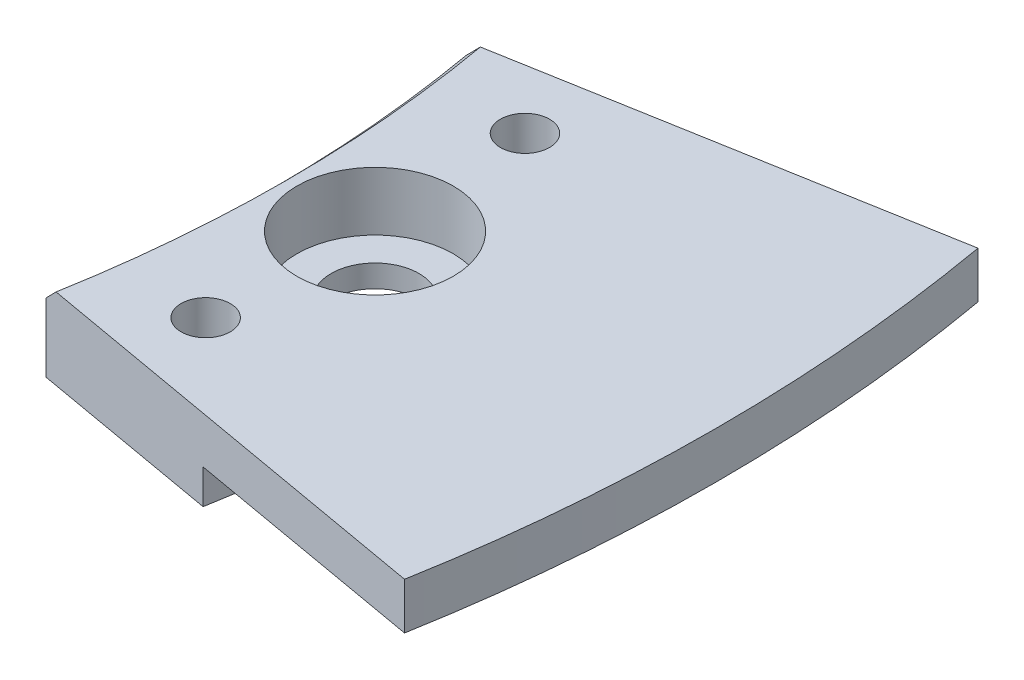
from build123d import *

# Parameters (mm, degrees)
REVOLVE1_ANGLE                 = 10
M2_5_DIAMETER_HOLE1_D          = 2.515
CBORE_FOR_M4_SHCS1_D           = 4.5
CBORE_FOR_M4_SHCS1_CBORE_D     = 8
CBORE_FOR_M4_SHCS1_CBORE_DEPTH = 3
CHAMFER3_SIZE                  = 0.635


with BuildPart() as part:
    # Sketch1 → Revolve1 (revolve)
    with BuildSketch(Plane.XY):
        Polygon((71.755, 1.762), (84.455, 1.762), (84.455, 4.14325), (61.849, 4.14325), (61.849, 0), (71.755, 0), align=None)
    revolve(axis=Axis((0, 0, 0), (0, 1, 0)), revolution_arc=REVOLVE1_ANGLE)

    # M2.5 Diameter Hole1 (through all)
    with Locations(Plane.XZ):
        with Locations((66.50059216, -8.165246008)):
            Hole(M2_5_DIAMETER_HOLE1_D / 2)

    # Mirror1: part across plane


with BuildPart() as part_1:
    add(part.part)
    add(part.part.mirror(Plane.XY))

    # CBORE for M4 SHCS1 (through all)
    with Locations(Plane(origin=(0, 4.14325, 0), x_dir=(-1, 0, 0), z_dir=(0, 1, 0))):
        with Locations((-67, 0)):
            CounterBoreHole(CBORE_FOR_M4_SHCS1_D / 2, CBORE_FOR_M4_SHCS1_CBORE_D / 2, CBORE_FOR_M4_SHCS1_CBORE_DEPTH)

    # Chamfer3
    chamfer3_edges = [part_1.edges().sort_by_distance(p)[0] for p in [
        (61.849, 4.14325, 0),
    ]]
    chamfer(chamfer3_edges, length=CHAMFER3_SIZE)


solid = part_1.part
